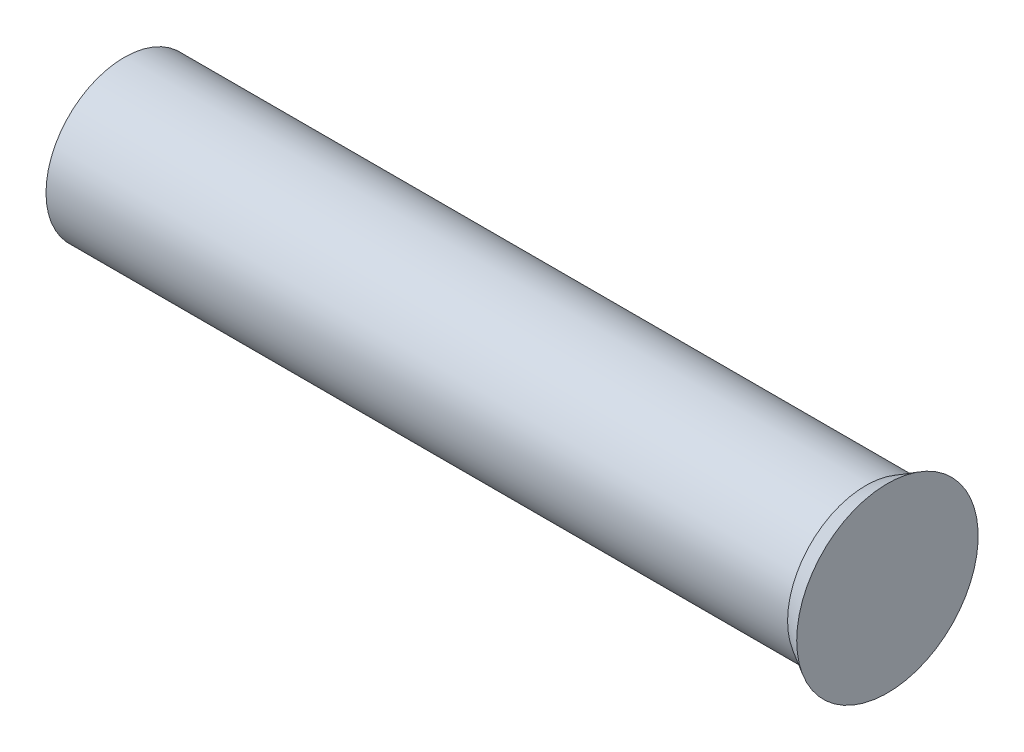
from build123d import *


with BuildPart() as part:
    # Sketch1 → Revolve1 (revolve)
    with BuildSketch(Plane.XY, mode=Mode.PRIVATE) as revolve1_sk:
        with BuildLine():
            Line((0.52274898, 1.9939), (19.414473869, 1.9939))
            Line((19.414473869, 1.9939), (19.9644, 2.3114))
            Line((19.9644, 2.3114), (19.9644, 0))
            Line((19.9644, 0), (0, 0))
            ThreePointArc((0, 0), (0.132858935, 1.030643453), (0.52274898, 1.9939))
        make_face()
    revolve(revolve1_sk.sketch.rotate(Axis((3.866888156, 0, 0), (1, 0, 0)), 90), axis=Axis((3.866888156, 0, 0), (1, 0, 0)))


solid = part.part
